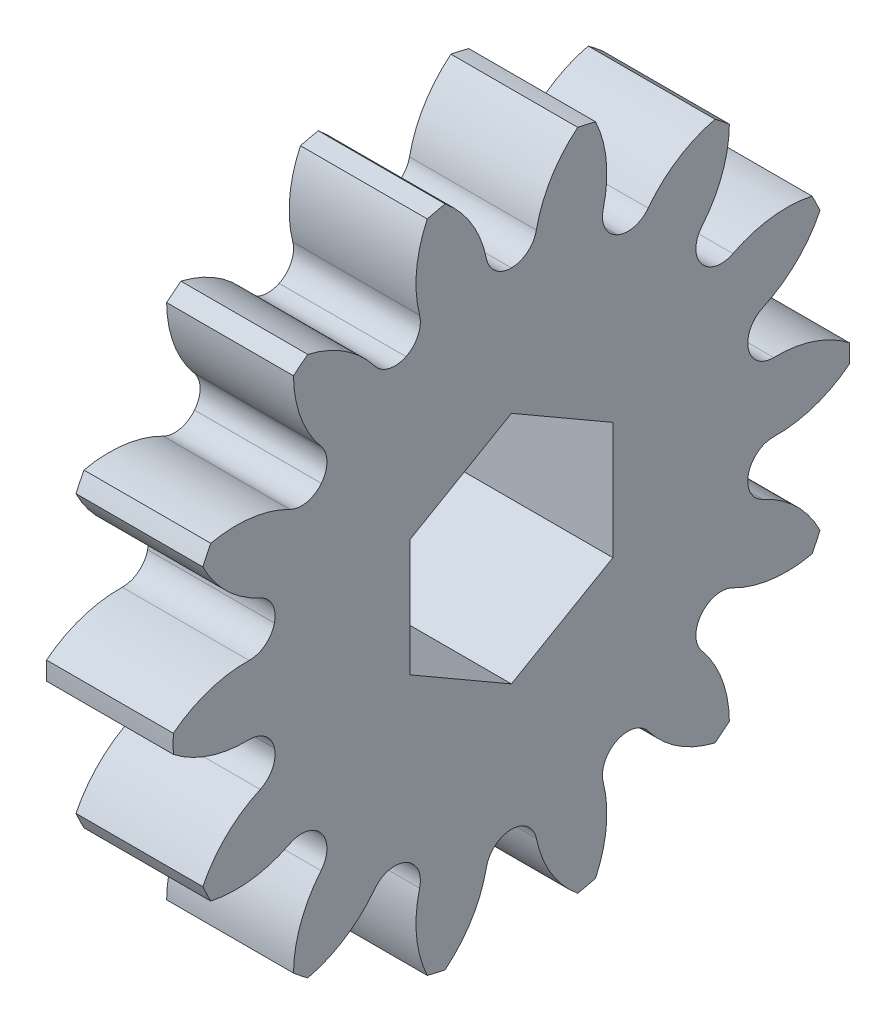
from build123d import *

# Parameters (mm, degrees)
SKETCH1_W           = 15
SKETCH1_H           = 40
CUT_EXTRUDE1_DEPTH  = 59.523499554
CUT_EXTRUDE2_DEPTH  = 59.523499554
CUT_EXTRUDE3_DEPTH  = 59.523499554
CUT_EXTRUDE4_DEPTH  = 59.523499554
CUT_EXTRUDE5_DEPTH  = 59.523499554
CUT_EXTRUDE6_DEPTH  = 59.523499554
CUT_EXTRUDE7_DEPTH  = 59.523499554
CUT_EXTRUDE8_DEPTH  = 59.523499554
CUT_EXTRUDE9_DEPTH  = 59.523499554
CUT_EXTRUDE10_DEPTH = 59.523499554
CUT_EXTRUDE11_DEPTH = 59.523499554
CUT_EXTRUDE12_DEPTH = 59.523499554
CUT_EXTRUDE13_DEPTH = 59.523499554
CUT_EXTRUDE14_DEPTH = 58.995558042
SKETCH16_R          = 19.5
BOSS_EXTRUDE1_DEPTH = 4
FILLET1_R           = 3
CUT_EXTRUDE16_DEPTH = 60.15644317


with BuildPart() as part:
    # Sketch1 → Revolve1 (revolve)
    with BuildSketch(Plane(origin=(0, 0, 0), x_dir=(-1, 0, 0), z_dir=(0, 0, -1)), mode=Mode.PRIVATE) as revolve1_sk:
        with Locations((-7.5, 20)):
            Rectangle(SKETCH1_W, SKETCH1_H)
    revolve(revolve1_sk.sketch.rotate(Axis((15, 0, 0), (-1, 0, 0)), 270), axis=Axis((15, 0, 0), (-1, 0, 0)))

    # Sketch2 → Cut-Extrude1 (cut, through all)
    with BuildSketch(Plane(origin=(15, 0, 0), x_dir=(0, 0, -1), z_dir=(1, 0, 0))):
        with BuildLine():
            ThreePointArc((35.556318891, 18.323432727), (31.273259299, 24.939592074), (25.7760513, 30.587500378))
            ThreePointArc((25.7760513, 30.587500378), (24.422511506, 24.701855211), (20.71573776, 19.933971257))
            ThreePointArc((20.71573776, 19.933971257), (22.476873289, 17.924708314), (24.043870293, 15.760625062))
            ThreePointArc((24.043870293, 15.760625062), (29.517048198, 18.313508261), (35.556318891, 18.323432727))
        make_face()
    extrude(amount=-CUT_EXTRUDE1_DEPTH, mode=Mode.SUBTRACT)

    # Sketch3 → Cut-Extrude2 (cut, through all)
    with BuildSketch(Plane(origin=(15, 0, 0), x_dir=(0, 0, -1), z_dir=(1, 0, 0))):
        with BuildLine():
            ThreePointArc((39.985375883, 1.08153385), (38.997116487, 8.900837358), (36.494838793, 16.37457607))
            ThreePointArc((36.494838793, 16.37457607), (32.721655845, 11.659071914), (27.313260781, 8.971665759))
            ThreePointArc((27.313260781, 8.971665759), (28.028202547, 6.39725433), (28.50105753, 3.767588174))
            ThreePointArc((28.50105753, 3.767588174), (34.539874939, 3.692933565), (39.985375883, 1.08153385))
        make_face()
    extrude(amount=-CUT_EXTRUDE2_DEPTH, mode=Mode.SUBTRACT)

    # Sketch4 → Cut-Extrude3 (cut, through all)
    with BuildSketch(Plane(origin=(15, 0, 0), x_dir=(0, 0, -1), z_dir=(1, 0, 0))):
        with BuildLine():
            ThreePointArc((36.494838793, -16.37457607), (38.997116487, -8.900837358), (39.985375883, -1.08153385))
            ThreePointArc((39.985375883, -1.08153385), (34.539874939, -3.692933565), (28.50105753, -3.767588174))
            ThreePointArc((28.50105753, -3.767588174), (28.028202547, -6.39725433), (27.313260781, -8.971665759))
            ThreePointArc((27.313260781, -8.971665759), (32.721655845, -11.659071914), (36.494838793, -16.37457607))
        make_face()
    extrude(amount=-CUT_EXTRUDE3_DEPTH, mode=Mode.SUBTRACT)

    # Sketch5 → Cut-Extrude4 (cut, through all)
    with BuildSketch(Plane(origin=(15, 0, 0), x_dir=(0, 0, -1), z_dir=(1, 0, 0))):
        with BuildLine():
            ThreePointArc((25.7760513, -30.587500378), (31.273259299, -24.939592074), (35.556318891, -18.323432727))
            ThreePointArc((35.556318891, -18.323432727), (29.517048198, -18.313508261), (24.043870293, -15.760625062))
            ThreePointArc((24.043870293, -15.760625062), (22.476873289, -17.924708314), (20.71573776, -19.933971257))
            ThreePointArc((20.71573776, -19.933971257), (24.422511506, -24.701855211), (25.7760513, -30.587500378))
        make_face()
    extrude(amount=-CUT_EXTRUDE4_DEPTH, mode=Mode.SUBTRACT)

    # Sketch6 → Cut-Extrude5 (cut, through all)
    with BuildSketch(Plane(origin=(15, 0, 0), x_dir=(0, 0, -1), z_dir=(1, 0, 0))):
        with BuildLine():
            ThreePointArc((9.952000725, -38.742195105), (17.355349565, -36.038754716), (24.084896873, -31.93615103))
            ThreePointArc((24.084896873, -31.93615103), (18.648008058, -29.306868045), (14.824499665, -24.632076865))
            ThreePointArc((14.824499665, -24.632076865), (12.473723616, -25.901953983), (10.015208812, -26.948109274))
            ThreePointArc((10.015208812, -26.948109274), (11.286189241, -32.852133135), (9.952000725, -38.742195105))
        make_face()
    extrude(amount=-CUT_EXTRUDE5_DEPTH, mode=Mode.SUBTRACT)

    # Sketch7 → Cut-Extrude6 (cut, through all)
    with BuildSketch(Plane(origin=(15, 0, 0), x_dir=(0, 0, -1), z_dir=(1, 0, 0))):
        with BuildLine():
            ThreePointArc((-7.843165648, -39.22352295), (0, -40), (7.843165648, -39.22352295))
            ThreePointArc((7.843165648, -39.22352295), (4.085501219, -34.495643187), (2.668955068, -28.624843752))
            ThreePointArc((2.668955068, -28.624843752), (0, -28.749), (-2.668955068, -28.624843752))
            ThreePointArc((-2.668955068, -28.624843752), (-4.085501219, -34.495643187), (-7.843165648, -39.22352295))
        make_face()
    extrude(amount=-CUT_EXTRUDE6_DEPTH, mode=Mode.SUBTRACT)

    # Sketch8 → Cut-Extrude7 (cut, through all)
    with BuildSketch(Plane(origin=(15, 0, 0), x_dir=(0, 0, -1), z_dir=(1, 0, 0))):
        with BuildLine():
            ThreePointArc((-24.084896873, -31.93615103), (-17.355349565, -36.038754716), (-9.952000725, -38.742195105))
            ThreePointArc((-9.952000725, -38.742195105), (-11.286189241, -32.852133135), (-10.015208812, -26.948109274))
            ThreePointArc((-10.015208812, -26.948109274), (-12.473723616, -25.901953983), (-14.824499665, -24.632076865))
            ThreePointArc((-14.824499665, -24.632076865), (-18.648008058, -29.306868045), (-24.084896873, -31.93615103))
        make_face()
    extrude(amount=-CUT_EXTRUDE7_DEPTH, mode=Mode.SUBTRACT)

    # Sketch9 → Cut-Extrude8 (cut, through all)
    with BuildSketch(Plane(origin=(15, 0, 0), x_dir=(0, 0, -1), z_dir=(1, 0, 0))):
        with BuildLine():
            ThreePointArc((-35.556318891, -18.323432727), (-31.273259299, -24.939592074), (-25.7760513, -30.587500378))
            ThreePointArc((-25.7760513, -30.587500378), (-24.422511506, -24.701855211), (-20.71573776, -19.933971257))
            ThreePointArc((-20.71573776, -19.933971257), (-22.476873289, -17.924708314), (-24.043870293, -15.760625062))
            ThreePointArc((-24.043870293, -15.760625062), (-29.517048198, -18.313508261), (-35.556318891, -18.323432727))
        make_face()
    extrude(amount=-CUT_EXTRUDE8_DEPTH, mode=Mode.SUBTRACT)

    # Sketch10 → Cut-Extrude9 (cut, through all)
    with BuildSketch(Plane(origin=(15, 0, 0), x_dir=(0, 0, -1), z_dir=(1, 0, 0))):
        with BuildLine():
            ThreePointArc((-39.985375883, -1.08153385), (-38.997116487, -8.900837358), (-36.494838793, -16.37457607))
            ThreePointArc((-36.494838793, -16.37457607), (-32.721655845, -11.659071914), (-27.313260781, -8.971665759))
            ThreePointArc((-27.313260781, -8.971665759), (-28.028202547, -6.39725433), (-28.50105753, -3.767588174))
            ThreePointArc((-28.50105753, -3.767588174), (-34.539874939, -3.692933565), (-39.985375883, -1.08153385))
        make_face()
    extrude(amount=-CUT_EXTRUDE9_DEPTH, mode=Mode.SUBTRACT)

    # Sketch11 → Cut-Extrude10 (cut, through all)
    with BuildSketch(Plane(origin=(15, 0, 0), x_dir=(0, 0, -1), z_dir=(1, 0, 0))):
        with BuildLine():
            ThreePointArc((-36.494838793, 16.37457607), (-38.997116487, 8.900837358), (-39.985375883, 1.08153385))
            ThreePointArc((-39.985375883, 1.08153385), (-34.539874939, 3.692933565), (-28.50105753, 3.767588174))
            ThreePointArc((-28.50105753, 3.767588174), (-28.028202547, 6.39725433), (-27.313260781, 8.971665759))
            ThreePointArc((-27.313260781, 8.971665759), (-32.721655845, 11.659071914), (-36.494838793, 16.37457607))
        make_face()
    extrude(amount=-CUT_EXTRUDE10_DEPTH, mode=Mode.SUBTRACT)

    # Sketch12 → Cut-Extrude11 (cut, through all)
    with BuildSketch(Plane(origin=(15, 0, 0), x_dir=(0, 0, -1), z_dir=(1, 0, 0))):
        with BuildLine():
            ThreePointArc((-25.7760513, 30.587500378), (-31.273259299, 24.939592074), (-35.556318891, 18.323432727))
            ThreePointArc((-35.556318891, 18.323432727), (-29.517048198, 18.313508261), (-24.043870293, 15.760625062))
            ThreePointArc((-24.043870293, 15.760625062), (-22.476873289, 17.924708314), (-20.71573776, 19.933971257))
            ThreePointArc((-20.71573776, 19.933971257), (-24.422511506, 24.701855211), (-25.7760513, 30.587500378))
        make_face()
    extrude(amount=-CUT_EXTRUDE11_DEPTH, mode=Mode.SUBTRACT)

    # Sketch13 → Cut-Extrude12 (cut, through all)
    with BuildSketch(Plane(origin=(15, 0, 0), x_dir=(0, 0, -1), z_dir=(1, 0, 0))):
        with BuildLine():
            ThreePointArc((-9.952000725, 38.742195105), (-17.355349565, 36.038754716), (-24.084896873, 31.93615103))
            ThreePointArc((-24.084896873, 31.93615103), (-18.648008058, 29.306868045), (-14.824499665, 24.632076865))
            ThreePointArc((-14.824499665, 24.632076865), (-12.473723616, 25.901953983), (-10.015208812, 26.948109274))
            ThreePointArc((-10.015208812, 26.948109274), (-11.286189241, 32.852133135), (-9.952000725, 38.742195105))
        make_face()
    extrude(amount=-CUT_EXTRUDE12_DEPTH, mode=Mode.SUBTRACT)

    # Sketch14 → Cut-Extrude13 (cut, through all)
    with BuildSketch(Plane(origin=(15, 0, 0), x_dir=(0, 0, -1), z_dir=(1, 0, 0))):
        with BuildLine():
            ThreePointArc((7.843165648, 39.22352295), (0, 40), (-7.843165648, 39.22352295))
            ThreePointArc((-7.843165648, 39.22352295), (-4.085501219, 34.495643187), (-2.668955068, 28.624843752))
            ThreePointArc((-2.668955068, 28.624843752), (0, 28.749), (2.668955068, 28.624843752))
            ThreePointArc((2.668955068, 28.624843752), (4.085501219, 34.495643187), (7.843165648, 39.22352295))
        make_face()
    extrude(amount=-CUT_EXTRUDE13_DEPTH, mode=Mode.SUBTRACT)

    # Sketch15 → Cut-Extrude14 (cut, through all)
    with BuildSketch(Plane(origin=(15, 0, 0), x_dir=(0, 0, -1), z_dir=(1, 0, 0))):
        with BuildLine():
            ThreePointArc((24.084896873, 31.93615103), (17.355349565, 36.038754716), (9.952000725, 38.742195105))
            ThreePointArc((9.952000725, 38.742195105), (11.286189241, 32.852133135), (10.015208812, 26.948109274))
            ThreePointArc((10.015208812, 26.948109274), (12.473723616, 25.901953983), (14.824499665, 24.632076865))
            ThreePointArc((14.824499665, 24.632076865), (18.648008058, 29.306868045), (24.084896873, 31.93615103))
        make_face()
    extrude(amount=-CUT_EXTRUDE14_DEPTH, mode=Mode.SUBTRACT)

    # Sketch16 → Boss-Extrude1 (add)
    with BuildSketch(Plane.ZY):
        Circle(SKETCH16_R)
    extrude(amount=BOSS_EXTRUDE1_DEPTH)

    # Fillet1
    fillet1_edges = [part.edges().sort_by_distance(p)[0] for p in [
        (7.5, -24.632076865, 14.824499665),
        (7.5, -26.948109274, 10.015208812),
        (7.5, -15.760625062, 24.043870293),
        (7.5, -19.933971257, 20.71573776),
        (7.5, 15.760625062, -24.043870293),
        (7.5, 19.933971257, -20.71573776),
        (7.5, -3.767588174, 28.50105753),
        (7.5, -8.971665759, 27.313260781),
        (7.5, 8.971665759, 27.313260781),
        (7.5, 3.767588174, 28.50105753),
        (7.5, 19.933971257, 20.71573776),
        (7.5, 15.760625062, 24.043870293),
        (7.5, 26.948109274, 10.015208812),
        (7.5, 24.632076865, 14.824499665),
        (7.5, 28.624843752, -2.668955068),
        (7.5, 28.624843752, 2.668955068),
        (7.5, 24.632076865, -14.824499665),
        (7.5, 26.948109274, -10.015208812),
        (7.5, 3.767588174, -28.50105753),
        (7.5, 8.971665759, -27.313260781),
        (7.5, -8.971665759, -27.313260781),
        (7.5, -3.767588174, -28.50105753),
        (7.5, -19.933971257, -20.71573776),
        (7.5, -15.760625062, -24.043870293),
        (7.5, -26.948109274, -10.015208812),
        (7.5, -24.632076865, -14.824499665),
        (7.5, -28.624843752, 2.668955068),
        (7.5, -28.624843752, -2.668955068),
    ]]
    fillet(fillet1_edges, radius=FILLET1_R)

    # Sketch17 → Cut-Extrude16 (cut, through all)
    with BuildSketch(Plane(origin=(15, 0, 0), x_dir=(0, 0, -1), z_dir=(1, 0, 0))):
        Polygon((0, 13.856406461), (-12, 6.92820323), (-12, -6.92820323), (0, -13.856406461), (12, -6.92820323), (12, 6.92820323), align=None)
    extrude(amount=-CUT_EXTRUDE16_DEPTH, mode=Mode.SUBTRACT)


solid = part.part
